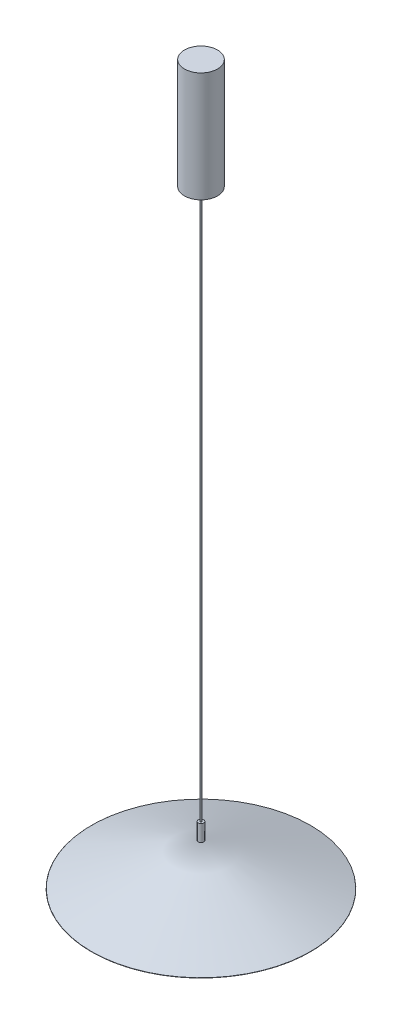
ISO-10303-21;
HEADER;
FILE_DESCRIPTION(('STEP AP214'),'2;1');
FILE_NAME('part.step','',(''),(''),'','','');
FILE_SCHEMA(('AUTOMOTIVE_DESIGN { 1 0 10303 214 1 1 1 1 }'));
ENDSEC;
DATA;
#1=APPLICATION_CONTEXT('core data for automotive mechanical design processes');
#2=APPLICATION_PROTOCOL_DEFINITION('international standard','automotive_design',2000,#1);
#3=PRODUCT_CONTEXT('',#1,'mechanical');
#4=PRODUCT('Part','Part','',(#3));
#5=PRODUCT_RELATED_PRODUCT_CATEGORY('part','',(#4));
#6=PRODUCT_DEFINITION_FORMATION('','',#4);
#7=PRODUCT_DEFINITION_CONTEXT('part definition',#1,'design');
#8=PRODUCT_DEFINITION('design','',#6,#7);
#9=PRODUCT_DEFINITION_SHAPE('','',#8);
#10=(LENGTH_UNIT() NAMED_UNIT(*) SI_UNIT(.MILLI.,.METRE.));
#11=(NAMED_UNIT(*) PLANE_ANGLE_UNIT() SI_UNIT($,.RADIAN.));
#12=(NAMED_UNIT(*) SI_UNIT($,.STERADIAN.) SOLID_ANGLE_UNIT());
#13=UNCERTAINTY_MEASURE_WITH_UNIT(LENGTH_MEASURE(1.E-05),#10,'distance_accuracy_value','');
#14=(GEOMETRIC_REPRESENTATION_CONTEXT(3) GLOBAL_UNCERTAINTY_ASSIGNED_CONTEXT((#13)) GLOBAL_UNIT_ASSIGNED_CONTEXT((#10,
#11,#12)) REPRESENTATION_CONTEXT('',''));
#15=CARTESIAN_POINT('',(0.,0.,0.));
#16=DIRECTION('',(0.,0.,1.));
#17=DIRECTION('',(1.,0.,0.));
#18=AXIS2_PLACEMENT_3D('',#15,#16,#17);
#19=CARTESIAN_POINT('',(0.,1306.,0.));
#20=DIRECTION('',(0.,-1.,0.));
#21=DIRECTION('',(0.,0.,-1.));
#22=AXIS2_PLACEMENT_3D('',#19,#20,#21);
#23=CYLINDRICAL_SURFACE('',#22,30.);
#24=CARTESIAN_POINT('',(0.,1306.,0.));
#25=DIRECTION('',(0.,1.,0.));
#26=DIRECTION('',(0.,0.,1.));
#27=AXIS2_PLACEMENT_3D('',#24,#25,#26);
#28=CIRCLE('',#27,30.);
#29=CARTESIAN_POINT('',(0.,1306.,30.));
#30=VERTEX_POINT('',#29);
#31=EDGE_CURVE('E12',#30,#30,#28,.T.);
#32=ORIENTED_EDGE('',*,*,#31,.F.);
#33=EDGE_LOOP('',(#32));
#34=FACE_BOUND('',#33,.T.);
#35=CARTESIAN_POINT('',(0.,1106.,0.));
#36=DIRECTION('',(0.,1.,0.));
#37=DIRECTION('',(0.,0.,1.));
#38=AXIS2_PLACEMENT_3D('',#35,#36,#37);
#39=CIRCLE('',#38,30.);
#40=CARTESIAN_POINT('',(0.,1106.,30.));
#41=VERTEX_POINT('',#40);
#42=EDGE_CURVE('E56',#41,#41,#39,.T.);
#43=ORIENTED_EDGE('',*,*,#42,.T.);
#44=EDGE_LOOP('',(#43));
#45=FACE_BOUND('',#44,.T.);
#46=ADVANCED_FACE('F53',(#34,#45),#23,.T.);
#47=CARTESIAN_POINT('',(0.,1306.,0.));
#48=DIRECTION('',(0.,1.,0.));
#49=DIRECTION('',(0.,0.,1.));
#50=AXIS2_PLACEMENT_3D('',#47,#48,#49);
#51=PLANE('',#50);
#52=ORIENTED_EDGE('',*,*,#31,.T.);
#53=EDGE_LOOP('',(#52));
#54=FACE_BOUND('',#53,.T.);
#55=ADVANCED_FACE('F68',(#54),#51,.T.);
#56=CARTESIAN_POINT('',(0.,1106.,0.));
#57=DIRECTION('',(0.,1.,0.));
#58=DIRECTION('',(0.,0.,1.));
#59=AXIS2_PLACEMENT_3D('',#56,#57,#58);
#60=PLANE('',#59);
#61=ORIENTED_EDGE('',*,*,#42,.F.);
#62=EDGE_LOOP('',(#61));
#63=FACE_BOUND('',#62,.T.);
#64=ADVANCED_FACE('F66',(#63),#60,.F.);
#65=CLOSED_SHELL('',(#46,#55,#64));
#66=MANIFOLD_SOLID_BREP('B2',#65);
#67=CARTESIAN_POINT('',(0.,1106.,0.));
#68=DIRECTION('',(0.,-1.,0.));
#69=DIRECTION('',(0.,0.,-1.));
#70=AXIS2_PLACEMENT_3D('',#67,#68,#69);
#71=CYLINDRICAL_SURFACE('',#70,1.5);
#72=CARTESIAN_POINT('',(0.,1106.,0.));
#73=DIRECTION('',(0.,1.,0.));
#74=DIRECTION('',(0.,0.,1.));
#75=AXIS2_PLACEMENT_3D('',#72,#73,#74);
#76=CIRCLE('',#75,1.5);
#77=CARTESIAN_POINT('',(0.,1106.,1.5));
#78=VERTEX_POINT('',#77);
#79=EDGE_CURVE('E52',#78,#78,#76,.T.);
#80=ORIENTED_EDGE('',*,*,#79,.F.);
#81=EDGE_LOOP('',(#80));
#82=FACE_BOUND('',#81,.T.);
#83=CARTESIAN_POINT('',(0.,106.,0.));
#84=DIRECTION('',(0.,1.,0.));
#85=DIRECTION('',(0.,0.,1.));
#86=AXIS2_PLACEMENT_3D('',#83,#84,#85);
#87=CIRCLE('',#86,1.5);
#88=CARTESIAN_POINT('',(0.,106.,1.5));
#89=VERTEX_POINT('',#88);
#90=EDGE_CURVE('E104',#89,#89,#87,.T.);
#91=ORIENTED_EDGE('',*,*,#90,.T.);
#92=EDGE_LOOP('',(#91));
#93=FACE_BOUND('',#92,.T.);
#94=ADVANCED_FACE('F101',(#82,#93),#71,.T.);
#95=CARTESIAN_POINT('',(0.,1106.,0.));
#96=DIRECTION('',(0.,1.,0.));
#97=DIRECTION('',(0.,0.,1.));
#98=AXIS2_PLACEMENT_3D('',#95,#96,#97);
#99=PLANE('',#98);
#100=ORIENTED_EDGE('',*,*,#79,.T.);
#101=EDGE_LOOP('',(#100));
#102=FACE_BOUND('',#101,.T.);
#103=ADVANCED_FACE('F116',(#102),#99,.T.);
#104=CARTESIAN_POINT('',(0.,106.,0.));
#105=DIRECTION('',(0.,1.,0.));
#106=DIRECTION('',(0.,0.,1.));
#107=AXIS2_PLACEMENT_3D('',#104,#105,#106);
#108=PLANE('',#107);
#109=ORIENTED_EDGE('',*,*,#90,.F.);
#110=EDGE_LOOP('',(#109));
#111=FACE_BOUND('',#110,.T.);
#112=ADVANCED_FACE('F114',(#111),#108,.F.);
#113=CLOSED_SHELL('',(#94,#103,#112));
#114=MANIFOLD_SOLID_BREP('B7',#113);
#115=CARTESIAN_POINT('',(0.,65.,0.));
#116=DIRECTION('',(0.,-1.,0.));
#117=DIRECTION('',(1.,0.,0.));
#118=AXIS2_PLACEMENT_3D('',#115,#116,#117);
#119=CYLINDRICAL_SURFACE('',#118,20.);
#120=CARTESIAN_POINT('',(0.,65.,0.));
#121=DIRECTION('',(0.,-1.,0.));
#122=DIRECTION('',(1.,0.,0.));
#123=AXIS2_PLACEMENT_3D('',#120,#121,#122);
#124=CIRCLE('',#123,20.);
#125=CARTESIAN_POINT('',(20.,65.,0.));
#126=VERTEX_POINT('',#125);
#127=EDGE_CURVE('E100',#126,#126,#124,.T.);
#128=ORIENTED_EDGE('',*,*,#127,.T.);
#129=EDGE_LOOP('',(#128));
#130=FACE_BOUND('',#129,.T.);
#131=CARTESIAN_POINT('',(0.,-55.,0.));
#132=DIRECTION('',(0.,-1.,0.));
#133=DIRECTION('',(1.,0.,0.));
#134=AXIS2_PLACEMENT_3D('',#131,#132,#133);
#135=CIRCLE('',#134,20.);
#136=CARTESIAN_POINT('',(20.,-55.,0.));
#137=VERTEX_POINT('',#136);
#138=EDGE_CURVE('E154',#137,#137,#135,.T.);
#139=ORIENTED_EDGE('',*,*,#138,.F.);
#140=EDGE_LOOP('',(#139));
#141=FACE_BOUND('',#140,.T.);
#142=ADVANCED_FACE('F151',(#130,#141),#119,.T.);
#143=CARTESIAN_POINT('',(0.,65.,0.));
#144=DIRECTION('',(0.,-1.,0.));
#145=DIRECTION('',(1.,0.,0.));
#146=AXIS2_PLACEMENT_3D('',#143,#144,#145);
#147=PLANE('',#146);
#148=ORIENTED_EDGE('',*,*,#127,.F.);
#149=EDGE_LOOP('',(#148));
#150=FACE_BOUND('',#149,.T.);
#151=ADVANCED_FACE('F166',(#150),#147,.F.);
#152=CARTESIAN_POINT('',(0.,-55.,0.));
#153=DIRECTION('',(0.,-1.,0.));
#154=DIRECTION('',(1.,0.,0.));
#155=AXIS2_PLACEMENT_3D('',#152,#153,#154);
#156=PLANE('',#155);
#157=ORIENTED_EDGE('',*,*,#138,.T.);
#158=EDGE_LOOP('',(#157));
#159=FACE_BOUND('',#158,.T.);
#160=ADVANCED_FACE('F163',(#159),#156,.T.);
#161=CLOSED_SHELL('',(#142,#151,#160));
#162=MANIFOLD_SOLID_BREP('B47',#161);
#163=CARTESIAN_POINT('',(0.,76.,0.));
#164=DIRECTION('',(0.,1.,0.));
#165=DIRECTION('',(0.,0.,1.));
#166=AXIS2_PLACEMENT_3D('',#163,#164,#165);
#167=PLANE('',#166);
#168=CARTESIAN_POINT('',(0.,76.,0.));
#169=DIRECTION('',(0.,1.,0.));
#170=DIRECTION('',(0.,0.,1.));
#171=AXIS2_PLACEMENT_3D('',#168,#169,#170);
#172=CIRCLE('',#171,5.);
#173=CARTESIAN_POINT('',(0.,76.,5.));
#174=VERTEX_POINT('',#173);
#175=EDGE_CURVE('E208',#174,#174,#172,.T.);
#176=ORIENTED_EDGE('',*,*,#175,.F.);
#177=EDGE_LOOP('',(#176));
#178=FACE_BOUND('',#177,.T.);
#179=ADVANCED_FACE('F201',(#178),#167,.F.);
#180=CARTESIAN_POINT('',(0.,106.,0.));
#181=DIRECTION('',(0.,1.,0.));
#182=DIRECTION('',(0.,0.,1.));
#183=AXIS2_PLACEMENT_3D('',#180,#181,#182);
#184=PLANE('',#183);
#185=CARTESIAN_POINT('',(0.,106.,0.));
#186=DIRECTION('',(0.,1.,0.));
#187=DIRECTION('',(0.,0.,1.));
#188=AXIS2_PLACEMENT_3D('',#185,#186,#187);
#189=CIRCLE('',#188,5.);
#190=CARTESIAN_POINT('',(0.,106.,5.));
#191=VERTEX_POINT('',#190);
#192=EDGE_CURVE('E149',#191,#191,#189,.T.);
#193=ORIENTED_EDGE('',*,*,#192,.T.);
#194=EDGE_LOOP('',(#193));
#195=FACE_BOUND('',#194,.T.);
#196=ADVANCED_FACE('F215',(#195),#184,.T.);
#197=CARTESIAN_POINT('',(0.,76.,0.));
#198=DIRECTION('',(0.,1.,0.));
#199=DIRECTION('',(0.,0.,1.));
#200=AXIS2_PLACEMENT_3D('',#197,#198,#199);
#201=CYLINDRICAL_SURFACE('',#200,5.);
#202=ORIENTED_EDGE('',*,*,#192,.F.);
#203=EDGE_LOOP('',(#202));
#204=FACE_BOUND('',#203,.T.);
#205=ORIENTED_EDGE('',*,*,#175,.T.);
#206=EDGE_LOOP('',(#205));
#207=FACE_BOUND('',#206,.T.);
#208=ADVANCED_FACE('F217',(#204,#207),#201,.T.);
#209=CLOSED_SHELL('',(#179,#196,#208));
#210=MANIFOLD_SOLID_BREP('B95',#209);
#211=CARTESIAN_POINT('',(0.,-50.,0.));
#212=DIRECTION('',(0.,1.,0.));
#213=DIRECTION('',(0.,0.,1.));
#214=AXIS2_PLACEMENT_3D('',#211,#212,#213);
#215=PLANE('',#214);
#216=CARTESIAN_POINT('',(0.,-50.,0.));
#217=DIRECTION('',(0.,1.,0.));
#218=DIRECTION('',(0.,0.,1.));
#219=AXIS2_PLACEMENT_3D('',#216,#217,#218);
#220=CIRCLE('',#219,74.);
#221=CARTESIAN_POINT('',(0.,-50.,74.));
#222=VERTEX_POINT('',#221);
#223=EDGE_CURVE('E298',#222,#222,#220,.T.);
#224=ORIENTED_EDGE('',*,*,#223,.T.);
#225=EDGE_LOOP('',(#224));
#226=FACE_BOUND('',#225,.T.);
#227=CARTESIAN_POINT('',(0.,-50.,0.));
#228=DIRECTION('',(0.,1.,0.));
#229=DIRECTION('',(0.,0.,1.));
#230=AXIS2_PLACEMENT_3D('',#227,#228,#229);
#231=CIRCLE('',#230,63.4629120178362);
#232=CARTESIAN_POINT('',(0.,-50.,63.4629120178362));
#233=VERTEX_POINT('',#232);
#234=EDGE_CURVE('E306',#233,#233,#231,.F.);
#235=ORIENTED_EDGE('',*,*,#234,.T.);
#236=EDGE_LOOP('',(#235));
#237=FACE_BOUND('',#236,.T.);
#238=ADVANCED_FACE('F253',(#226,#237),#215,.T.);
#239=CARTESIAN_POINT('',(0.,-79.8893624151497,0.));
#240=DIRECTION('',(0.,1.,0.));
#241=DIRECTION('',(0.,0.,1.));
#242=AXIS2_PLACEMENT_3D('',#239,#240,#241);
#243=CONICAL_SURFACE('',#242,0.276593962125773,1.19028994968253);
#244=CARTESIAN_POINT('',(0.,-79.8178391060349,0.));
#245=DIRECTION('',(0.,-1.,0.));
#246=DIRECTION('',(0.,0.,-1.));
#247=AXIS2_PLACEMENT_3D('',#244,#245,#246);
#248=CIRCLE('',#247,0.455402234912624);
#249=CARTESIAN_POINT('',(0.,-79.8178391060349,0.45540223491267));
#250=VERTEX_POINT('',#249);
#251=EDGE_CURVE('E199',#250,#250,#248,.F.);
#252=CARTESIAN_POINT('',(0.,-50.2857142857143,0.));
#253=DIRECTION('',(0.,-1.,0.));
#254=DIRECTION('',(0.,0.,-1.));
#255=AXIS2_PLACEMENT_3D('',#252,#253,#254);
#256=CIRCLE('',#255,74.2857142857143);
#257=CARTESIAN_POINT('',(0.,-50.2857142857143,74.2857142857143));
#258=VERTEX_POINT('',#257);
#259=EDGE_CURVE('E301',#258,#258,#256,.T.);
#260=CARTESIAN_POINT('',(0.,-79.8178391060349,0.45540223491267));
#261=CARTESIAN_POINT('',(0.,-79.5102128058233,1.22446798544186));
#262=CARTESIAN_POINT('',(0.,-79.2025865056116,1.99353373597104));
#263=CARTESIAN_POINT('',(0.,-78.5873339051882,3.5316652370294));
#264=CARTESIAN_POINT('',(0.,-78.2797076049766,4.30073098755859));
#265=CARTESIAN_POINT('',(0.,-77.6644550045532,5.83886248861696));
#266=CARTESIAN_POINT('',(0.,-77.3568287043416,6.60792823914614));
#267=CARTESIAN_POINT('',(0.,-76.7415761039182,8.14605974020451));
#268=CARTESIAN_POINT('',(0.,-76.4339498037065,8.91512549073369));
#269=CARTESIAN_POINT('',(0.,-75.8186972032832,10.4532569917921));
#270=CARTESIAN_POINT('',(0.,-75.5110709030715,11.2223227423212));
#271=CARTESIAN_POINT('',(0.,-74.8958183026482,12.7604542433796));
#272=CARTESIAN_POINT('',(0.,-74.5881920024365,13.5295199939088));
#273=CARTESIAN_POINT('',(0.,-73.9729394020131,15.0676514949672));
#274=CARTESIAN_POINT('',(0.,-73.6653131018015,15.8367172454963));
#275=CARTESIAN_POINT('',(0.,-73.0500605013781,17.3748487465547));
#276=CARTESIAN_POINT('',(0.,-72.7424342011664,18.1439144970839));
#277=CARTESIAN_POINT('',(0.,-72.1271816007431,19.6820459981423));
#278=CARTESIAN_POINT('',(0.,-71.8195553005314,20.4511117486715));
#279=CARTESIAN_POINT('',(0.,-71.2043027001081,21.9892432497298));
#280=CARTESIAN_POINT('',(0.,-70.8966763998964,22.758309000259));
#281=CARTESIAN_POINT('',(0.,-70.281423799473,24.2964405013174));
#282=CARTESIAN_POINT('',(0.,-69.9737974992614,25.0655062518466));
#283=CARTESIAN_POINT('',(0.,-69.358544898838,26.6036377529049));
#284=CARTESIAN_POINT('',(0.,-69.0509185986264,27.3727035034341));
#285=CARTESIAN_POINT('',(0.,-68.435665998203,28.9108350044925));
#286=CARTESIAN_POINT('',(0.,-68.1280396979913,29.6799007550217));
#287=CARTESIAN_POINT('',(0.,-67.512787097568,31.21803225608));
#288=CARTESIAN_POINT('',(0.,-67.2051607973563,31.9870980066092));
#289=CARTESIAN_POINT('',(0.,-66.589908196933,33.5252295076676));
#290=CARTESIAN_POINT('',(0.,-66.2822818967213,34.2942952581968));
#291=CARTESIAN_POINT('',(0.,-65.6670292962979,35.8324267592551));
#292=CARTESIAN_POINT('',(0.,-65.3594029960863,36.6014925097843));
#293=CARTESIAN_POINT('',(0.,-64.7441503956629,38.1396240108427));
#294=CARTESIAN_POINT('',(0.,-64.4365240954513,38.9086897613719));
#295=CARTESIAN_POINT('',(0.,-63.8212714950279,40.4468212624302));
#296=CARTESIAN_POINT('',(0.,-63.5136451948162,41.2158870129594));
#297=CARTESIAN_POINT('',(0.,-62.8983925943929,42.7540185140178));
#298=CARTESIAN_POINT('',(0.,-62.5907662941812,43.523084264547));
#299=CARTESIAN_POINT('',(0.,-61.9755136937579,45.0612157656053));
#300=CARTESIAN_POINT('',(0.,-61.6678873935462,45.8302815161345));
#301=CARTESIAN_POINT('',(0.,-61.0526347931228,47.3684130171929));
#302=CARTESIAN_POINT('',(0.,-60.7450084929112,48.1374787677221));
#303=CARTESIAN_POINT('',(0.,-60.1297558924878,49.6756102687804));
#304=CARTESIAN_POINT('',(0.,-59.8221295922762,50.4446760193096));
#305=CARTESIAN_POINT('',(0.,-59.2068769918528,51.982807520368));
#306=CARTESIAN_POINT('',(0.,-58.8992506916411,52.7518732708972));
#307=CARTESIAN_POINT('',(0.,-58.2839980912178,54.2900047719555));
#308=CARTESIAN_POINT('',(0.,-57.9763717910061,55.0590705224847));
#309=CARTESIAN_POINT('',(0.,-57.3611191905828,56.5972020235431));
#310=CARTESIAN_POINT('',(0.,-57.0534928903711,57.3662677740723));
#311=CARTESIAN_POINT('',(0.,-56.4382402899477,58.9043992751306));
#312=CARTESIAN_POINT('',(0.,-56.1306139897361,59.6734650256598));
#313=CARTESIAN_POINT('',(0.,-55.5153613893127,61.2115965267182));
#314=CARTESIAN_POINT('',(0.,-55.207735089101,61.9806622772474));
#315=CARTESIAN_POINT('',(0.,-54.5924824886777,63.5187937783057));
#316=CARTESIAN_POINT('',(0.,-54.284856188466,64.2878595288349));
#317=CARTESIAN_POINT('',(0.,-53.6696035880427,65.8259910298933));
#318=CARTESIAN_POINT('',(0.,-53.361977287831,66.5950567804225));
#319=CARTESIAN_POINT('',(0.,-52.7467246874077,68.1331882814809));
#320=CARTESIAN_POINT('',(0.,-52.439098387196,68.90225403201));
#321=CARTESIAN_POINT('',(0.,-51.8238457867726,70.4403855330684));
#322=CARTESIAN_POINT('',(0.,-51.516219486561,71.2094512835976));
#323=CARTESIAN_POINT('',(0.,-50.9009668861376,72.747582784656));
#324=CARTESIAN_POINT('',(0.,-50.5933405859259,73.5166485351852));
#325=CARTESIAN_POINT('',(0.,-50.2857142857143,74.2857142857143));
#326=B_SPLINE_CURVE_WITH_KNOTS('',3,(#260,#261,#262,#263,#264,#265,#266,#267,#268,#269,#270,
#271,#272,#273,#274,#275,#276,#277,#278,#279,#280,#281,#282,#283,#284,#285,#286,#287,#288,#289,
#290,#291,#292,#293,#294,#295,#296,#297,#298,#299,#300,#301,#302,#303,#304,#305,#306,#307,#308,
#309,#310,#311,#312,#313,#314,#315,#316,#317,#318,#319,#320,#321,#322,#323,#324,#325),
.UNSPECIFIED.,.F.,.F.,(4,2,2,2,2,2,2,2,2,2,2,2,2,2,2,2,2,2,2,2,2,2,2,2,2,2,2,2,2,2,2,2,4),(0.,
2.48492748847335,4.9698549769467,7.45478246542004,9.93970995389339,12.4246374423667,
14.9095649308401,17.3944924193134,19.8794199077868,22.3643473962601,24.8492748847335,
27.3342023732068,29.8191298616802,32.3040573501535,34.7889848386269,37.2739123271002,
39.7588398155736,42.2437673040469,44.7286947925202,47.2136222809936,49.6985497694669,
52.1834772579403,54.6684047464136,57.153332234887,59.6382597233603,62.1231872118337,
64.608114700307,67.0930421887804,69.5779696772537,72.062897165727,74.5478246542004,
77.0327521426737,79.5176796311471),.UNSPECIFIED.);
#327=EDGE_CURVE('BSEAM276',#250,#258,#326,.T.);
#328=ORIENTED_EDGE('',*,*,#251,.T.);
#329=ORIENTED_EDGE('',*,*,#259,.T.);
#330=ORIENTED_EDGE('',*,*,#327,.T.);
#331=ORIENTED_EDGE('',*,*,#327,.F.);
#332=EDGE_LOOP('',(#328,#330,#329,#331));
#333=FACE_BOUND('',#332,.T.);
#334=ADVANCED_FACE('F276',(#333),#243,.T.);
#335=CARTESIAN_POINT('',(0.,-79.8893624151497,0.));
#336=DIRECTION('',(0.,-1.,0.));
#337=DIRECTION('',(0.,0.,-1.));
#338=AXIS2_PLACEMENT_3D('',#335,#336,#337);
#339=PLANE('',#338);
#340=CARTESIAN_POINT('',(0.,-79.8893624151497,0.));
#341=DIRECTION('',(0.,-1.,0.));
#342=DIRECTION('',(0.,0.,-1.));
#343=AXIS2_PLACEMENT_3D('',#340,#341,#342);
#344=CIRCLE('',#343,0.0840115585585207);
#345=CARTESIAN_POINT('',(0.,-79.8893624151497,-0.0840115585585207));
#346=VERTEX_POINT('',#345);
#347=EDGE_CURVE('E260',#346,#346,#344,.T.);
#348=ORIENTED_EDGE('',*,*,#347,.T.);
#349=EDGE_LOOP('',(#348));
#350=FACE_BOUND('',#349,.T.);
#351=ADVANCED_FACE('F266',(#350),#339,.T.);
#352=CARTESIAN_POINT('',(0.,-74.5041976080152,0.));
#353=DIRECTION('',(0.,1.,0.));
#354=DIRECTION('',(0.,0.,1.));
#355=AXIS2_PLACEMENT_3D('',#352,#353,#354);
#356=CONICAL_SURFACE('',#355,0.276593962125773,1.19028994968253);
#357=CARTESIAN_POINT('',(0.,-50.7152330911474,0.));
#358=DIRECTION('',(0.,1.,0.));
#359=DIRECTION('',(0.,0.,1.));
#360=AXIS2_PLACEMENT_3D('',#357,#358,#359);
#361=CIRCLE('',#360,59.7490052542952);
#362=CARTESIAN_POINT('',(0.,-50.7152330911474,59.7490052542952));
#363=VERTEX_POINT('',#362);
#364=EDGE_CURVE('E303',#363,#363,#361,.T.);
#365=ORIENTED_EDGE('',*,*,#364,.T.);
#366=EDGE_LOOP('',(#365));
#367=FACE_BOUND('',#366,.T.);
#368=CARTESIAN_POINT('',(0.,-74.6148351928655,0.));
#369=VERTEX_POINT('',#368);
#370=VERTEX_LOOP('',#369);
#371=FACE_BOUND('',#370,.T.);
#372=ADVANCED_FACE('F263',(#367,#371),#356,.F.);
#373=CARTESIAN_POINT('',(0.,-60.,0.));
#374=DIRECTION('',(0.,1.,0.));
#375=DIRECTION('',(0.,0.,1.));
#376=AXIS2_PLACEMENT_3D('',#373,#374,#375);
#377=TOROIDAL_SURFACE('',#376,63.4629120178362,10.);
#378=ORIENTED_EDGE('',*,*,#364,.F.);
#379=EDGE_LOOP('',(#378));
#380=FACE_BOUND('',#379,.T.);
#381=ORIENTED_EDGE('',*,*,#234,.F.);
#382=EDGE_LOOP('',(#381));
#383=FACE_BOUND('',#382,.T.);
#384=ADVANCED_FACE('F265',(#380,#383),#377,.T.);
#385=CARTESIAN_POINT('',(0.,-50.2857142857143,0.));
#386=DIRECTION('',(0.,-1.,0.));
#387=DIRECTION('',(0.,0.,-1.));
#388=AXIS2_PLACEMENT_3D('',#385,#386,#387);
#389=CONICAL_SURFACE('',#388,74.2857142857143,0.785398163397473);
#390=ORIENTED_EDGE('',*,*,#223,.F.);
#391=EDGE_LOOP('',(#390));
#392=FACE_BOUND('',#391,.T.);
#393=ORIENTED_EDGE('',*,*,#259,.F.);
#394=EDGE_LOOP('',(#393));
#395=FACE_BOUND('',#394,.T.);
#396=ADVANCED_FACE('F273',(#392,#395),#389,.T.);
#397=CARTESIAN_POINT('',(0.,-78.8893624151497,0.));
#398=DIRECTION('',(0.,-1.,0.));
#399=DIRECTION('',(0.,0.,-1.));
#400=AXIS2_PLACEMENT_3D('',#397,#398,#399);
#401=DEGENERATE_TOROIDAL_SURFACE('',#400,0.0840115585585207,1.,.T.);
#402=ORIENTED_EDGE('',*,*,#251,.F.);
#403=EDGE_LOOP('',(#402));
#404=FACE_BOUND('',#403,.T.);
#405=ORIENTED_EDGE('',*,*,#347,.F.);
#406=EDGE_LOOP('',(#405));
#407=FACE_BOUND('',#406,.T.);
#408=ADVANCED_FACE('F255',(#404,#407),#401,.T.);
#409=CLOSED_SHELL('',(#238,#334,#351,#372,#384,#396,#408));
#410=MANIFOLD_SOLID_BREP('B143',#409);
#411=CARTESIAN_POINT('',(0.,55.,0.));
#412=DIRECTION('',(0.,-1.,0.));
#413=DIRECTION('',(1.,0.,0.));
#414=AXIS2_PLACEMENT_3D('',#411,#412,#413);
#415=PLANE('',#414);
#416=CARTESIAN_POINT('',(0.,55.,0.));
#417=DIRECTION('',(0.,-1.,0.));
#418=DIRECTION('',(1.,0.,0.));
#419=AXIS2_PLACEMENT_3D('',#416,#417,#418);
#420=CIRCLE('',#419,37.);
#421=CARTESIAN_POINT('',(37.,55.,0.));
#422=VERTEX_POINT('',#421);
#423=EDGE_CURVE('E381',#422,#422,#420,.T.);
#424=ORIENTED_EDGE('',*,*,#423,.T.);
#425=EDGE_LOOP('',(#424));
#426=FACE_BOUND('',#425,.T.);
#427=CARTESIAN_POINT('',(0.,55.,0.));
#428=DIRECTION('',(0.,-1.,0.));
#429=DIRECTION('',(1.,0.,0.));
#430=AXIS2_PLACEMENT_3D('',#427,#428,#429);
#431=CIRCLE('',#430,40.);
#432=CARTESIAN_POINT('',(40.,55.,0.));
#433=VERTEX_POINT('',#432);
#434=EDGE_CURVE('E251',#433,#433,#431,.T.);
#435=ORIENTED_EDGE('',*,*,#434,.F.);
#436=EDGE_LOOP('',(#435));
#437=FACE_BOUND('',#436,.T.);
#438=ADVANCED_FACE('F364',(#426,#437),#415,.F.);
#439=CARTESIAN_POINT('',(0.,55.,0.));
#440=DIRECTION('',(0.,-1.,0.));
#441=DIRECTION('',(1.,0.,0.));
#442=AXIS2_PLACEMENT_3D('',#439,#440,#441);
#443=CYLINDRICAL_SURFACE('',#442,40.);
#444=ORIENTED_EDGE('',*,*,#434,.T.);
#445=EDGE_LOOP('',(#444));
#446=FACE_BOUND('',#445,.T.);
#447=CARTESIAN_POINT('',(0.,-55.,0.));
#448=DIRECTION('',(0.,-1.,0.));
#449=DIRECTION('',(1.,0.,0.));
#450=AXIS2_PLACEMENT_3D('',#447,#448,#449);
#451=CIRCLE('',#450,40.);
#452=CARTESIAN_POINT('',(40.,-55.,0.));
#453=VERTEX_POINT('',#452);
#454=EDGE_CURVE('E370',#453,#453,#451,.T.);
#455=ORIENTED_EDGE('',*,*,#454,.F.);
#456=EDGE_LOOP('',(#455));
#457=FACE_BOUND('',#456,.T.);
#458=ADVANCED_FACE('F374',(#446,#457),#443,.T.);
#459=CARTESIAN_POINT('',(0.,-55.,0.));
#460=DIRECTION('',(0.,-1.,0.));
#461=DIRECTION('',(1.,0.,0.));
#462=AXIS2_PLACEMENT_3D('',#459,#460,#461);
#463=PLANE('',#462);
#464=CARTESIAN_POINT('',(0.,-55.,0.));
#465=DIRECTION('',(0.,-1.,0.));
#466=DIRECTION('',(1.,0.,0.));
#467=AXIS2_PLACEMENT_3D('',#464,#465,#466);
#468=CIRCLE('',#467,37.);
#469=CARTESIAN_POINT('',(37.,-55.,0.));
#470=VERTEX_POINT('',#469);
#471=EDGE_CURVE('E383',#470,#470,#468,.T.);
#472=ORIENTED_EDGE('',*,*,#471,.F.);
#473=EDGE_LOOP('',(#472));
#474=FACE_BOUND('',#473,.T.);
#475=ORIENTED_EDGE('',*,*,#454,.T.);
#476=EDGE_LOOP('',(#475));
#477=FACE_BOUND('',#476,.T.);
#478=ADVANCED_FACE('F377',(#474,#477),#463,.T.);
#479=CARTESIAN_POINT('',(0.,105.,0.));
#480=DIRECTION('',(0.,-1.,0.));
#481=DIRECTION('',(1.,0.,0.));
#482=AXIS2_PLACEMENT_3D('',#479,#480,#481);
#483=CYLINDRICAL_SURFACE('',#482,37.);
#484=ORIENTED_EDGE('',*,*,#471,.T.);
#485=EDGE_LOOP('',(#484));
#486=FACE_BOUND('',#485,.T.);
#487=ORIENTED_EDGE('',*,*,#423,.F.);
#488=EDGE_LOOP('',(#487));
#489=FACE_BOUND('',#488,.T.);
#490=ADVANCED_FACE('F389',(#486,#489),#483,.F.);
#491=CLOSED_SHELL('',(#438,#458,#478,#490));
#492=MANIFOLD_SOLID_BREP('B193',#491);
#493=CARTESIAN_POINT('',(0.,0.,0.));
#494=DIRECTION('',(0.,-1.,0.));
#495=DIRECTION('',(0.,0.,-1.));
#496=AXIS2_PLACEMENT_3D('',#493,#494,#495);
#497=CONICAL_SURFACE('',#496,200.,1.19894025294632);
#498=CARTESIAN_POINT('',(0.,0.386330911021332,0.));
#499=DIRECTION('',(0.,1.,0.));
#500=DIRECTION('',(0.,0.,1.));
#501=AXIS2_PLACEMENT_3D('',#498,#499,#500);
#502=CIRCLE('',#501,199.009407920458);
#503=CARTESIAN_POINT('',(0.,0.386330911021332,199.009407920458));
#504=VERTEX_POINT('',#503);
#505=EDGE_CURVE('E362',#504,#504,#502,.T.);
#506=ORIENTED_EDGE('',*,*,#505,.T.);
#507=EDGE_LOOP('',(#506));
#508=FACE_BOUND('',#507,.T.);
#509=CARTESIAN_POINT('',(0.,78.,0.));
#510=VERTEX_POINT('',#509);
#511=VERTEX_LOOP('',#510);
#512=FACE_BOUND('',#511,.T.);
#513=ADVANCED_FACE('F428',(#508,#512),#497,.T.);
#514=CARTESIAN_POINT('',(0.,0.,0.));
#515=DIRECTION('',(0.,-1.,0.));
#516=DIRECTION('',(0.,0.,-1.));
#517=AXIS2_PLACEMENT_3D('',#514,#515,#516);
#518=PLANE('',#517);
#519=CARTESIAN_POINT('',(0.,0.,0.));
#520=DIRECTION('',(0.,-1.,0.));
#521=DIRECTION('',(0.,0.,-1.));
#522=AXIS2_PLACEMENT_3D('',#519,#520,#521);
#523=CIRCLE('',#522,198.93673886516);
#524=CARTESIAN_POINT('',(0.,0.,-198.93673886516));
#525=VERTEX_POINT('',#524);
#526=EDGE_CURVE('E436',#525,#525,#523,.T.);
#527=ORIENTED_EDGE('',*,*,#526,.T.);
#528=EDGE_LOOP('',(#527));
#529=FACE_BOUND('',#528,.T.);
#530=CARTESIAN_POINT('',(0.,0.,0.));
#531=DIRECTION('',(0.,-1.,0.));
#532=DIRECTION('',(0.,0.,-1.));
#533=AXIS2_PLACEMENT_3D('',#530,#531,#532);
#534=CIRCLE('',#533,194.495593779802);
#535=CARTESIAN_POINT('',(0.,0.,-194.495593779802));
#536=VERTEX_POINT('',#535);
#537=EDGE_CURVE('E449',#536,#536,#534,.T.);
#538=ORIENTED_EDGE('',*,*,#537,.F.);
#539=EDGE_LOOP('',(#538));
#540=FACE_BOUND('',#539,.T.);
#541=ADVANCED_FACE('F445',(#529,#540),#518,.T.);
#542=CARTESIAN_POINT('',(0.,-1.86330911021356,0.));
#543=DIRECTION('',(0.,-1.,0.));
#544=DIRECTION('',(0.,0.,-1.));
#545=AXIS2_PLACEMENT_3D('',#542,#543,#544);
#546=CONICAL_SURFACE('',#545,199.273309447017,1.19894025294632);
#547=CARTESIAN_POINT('',(0.,75.853281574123,0.));
#548=VERTEX_POINT('',#547);
#549=VERTEX_LOOP('',#548);
#550=FACE_BOUND('',#549,.T.);
#551=ORIENTED_EDGE('',*,*,#537,.T.);
#552=EDGE_LOOP('',(#551));
#553=FACE_BOUND('',#552,.T.);
#554=ADVANCED_FACE('F442',(#550,#553),#546,.F.);
#555=CARTESIAN_POINT('',(0.,0.2,0.));
#556=DIRECTION('',(0.,-1.,0.));
#557=DIRECTION('',(0.,0.,-1.));
#558=AXIS2_PLACEMENT_3D('',#555,#556,#557);
#559=TOROIDAL_SURFACE('',#558,198.93673886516,0.2);
#560=ORIENTED_EDGE('',*,*,#505,.F.);
#561=EDGE_LOOP('',(#560));
#562=FACE_BOUND('',#561,.T.);
#563=ORIENTED_EDGE('',*,*,#526,.F.);
#564=EDGE_LOOP('',(#563));
#565=FACE_BOUND('',#564,.T.);
#566=ADVANCED_FACE('F430',(#562,#565),#559,.T.);
#567=CLOSED_SHELL('',(#513,#541,#554,#566));
#568=MANIFOLD_SOLID_BREP('B245',#567);
#569=ADVANCED_BREP_SHAPE_REPRESENTATION('',(#18,#66,#114,#162,#210,#410,#492,#568),#14);
#570=SHAPE_DEFINITION_REPRESENTATION(#9,#569);
ENDSEC;
END-ISO-10303-21;
